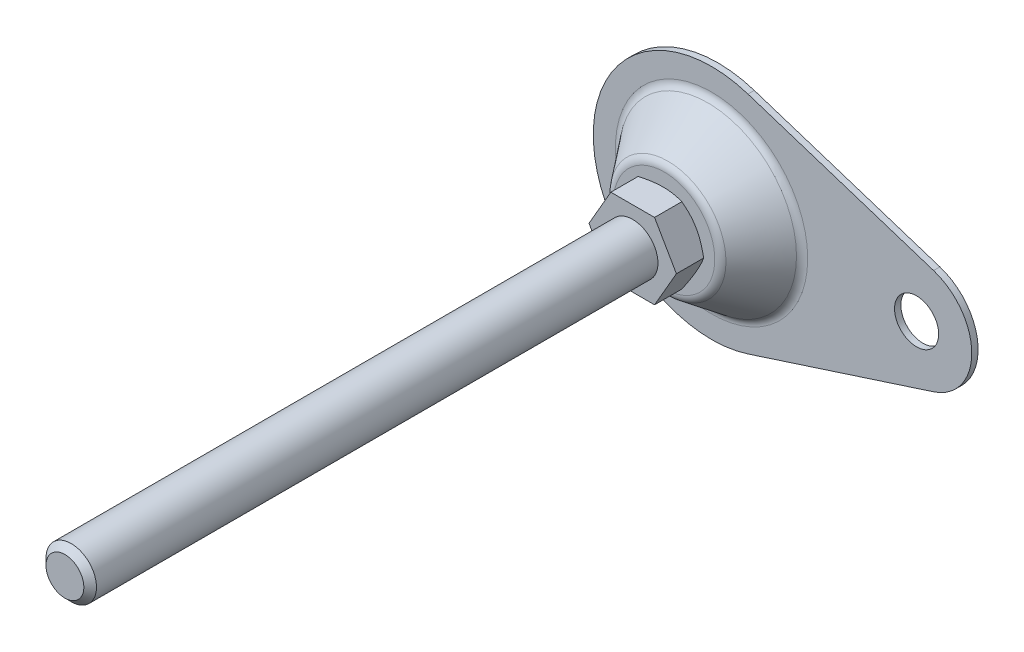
ISO-10303-21;
HEADER;
FILE_DESCRIPTION(('STEP AP214'),'2;1');
FILE_NAME('part.step','',(''),(''),'','','');
FILE_SCHEMA(('AUTOMOTIVE_DESIGN { 1 0 10303 214 1 1 1 1 }'));
ENDSEC;
DATA;
#1=APPLICATION_CONTEXT('core data for automotive mechanical design processes');
#2=APPLICATION_PROTOCOL_DEFINITION('international standard','automotive_design',2000,#1);
#3=PRODUCT_CONTEXT('',#1,'mechanical');
#4=PRODUCT('Part','Part','',(#3));
#5=PRODUCT_RELATED_PRODUCT_CATEGORY('part','',(#4));
#6=PRODUCT_DEFINITION_FORMATION('','',#4);
#7=PRODUCT_DEFINITION_CONTEXT('part definition',#1,'design');
#8=PRODUCT_DEFINITION('design','',#6,#7);
#9=PRODUCT_DEFINITION_SHAPE('','',#8);
#10=(LENGTH_UNIT() NAMED_UNIT(*) SI_UNIT(.MILLI.,.METRE.));
#11=(NAMED_UNIT(*) PLANE_ANGLE_UNIT() SI_UNIT($,.RADIAN.));
#12=(NAMED_UNIT(*) SI_UNIT($,.STERADIAN.) SOLID_ANGLE_UNIT());
#13=UNCERTAINTY_MEASURE_WITH_UNIT(LENGTH_MEASURE(1.E-05),#10,'distance_accuracy_value','');
#14=(GEOMETRIC_REPRESENTATION_CONTEXT(3) GLOBAL_UNCERTAINTY_ASSIGNED_CONTEXT((#13)) GLOBAL_UNIT_ASSIGNED_CONTEXT((#10,
#11,#12)) REPRESENTATION_CONTEXT('',''));
#15=CARTESIAN_POINT('',(0.,0.,0.));
#16=DIRECTION('',(0.,0.,1.));
#17=DIRECTION('',(1.,0.,0.));
#18=AXIS2_PLACEMENT_3D('',#15,#16,#17);
#19=CARTESIAN_POINT('',(65.,0.,2.));
#20=DIRECTION('',(0.,0.,1.));
#21=DIRECTION('',(1.,0.,0.));
#22=AXIS2_PLACEMENT_3D('',#19,#20,#21);
#23=PLANE('',#22);
#24=CARTESIAN_POINT('',(0.,0.,2.));
#25=DIRECTION('',(0.,0.,1.));
#26=DIRECTION('',(1.,0.,0.));
#27=AXIS2_PLACEMENT_3D('',#24,#25,#26);
#28=CIRCLE('',#27,30.4802116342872);
#29=CARTESIAN_POINT('',(30.4802116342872,0.,2.));
#30=VERTEX_POINT('',#29);
#31=EDGE_CURVE('E245',#30,#30,#28,.F.);
#32=ORIENTED_EDGE('',*,*,#31,.T.);
#33=EDGE_LOOP('',(#32));
#34=FACE_BOUND('',#33,.T.);
#35=CARTESIAN_POINT('',(65.,0.,2.));
#36=DIRECTION('',(0.,0.,1.));
#37=DIRECTION('',(1.,0.,0.));
#38=AXIS2_PLACEMENT_3D('',#35,#36,#37);
#39=CIRCLE('',#38,7.);
#40=CARTESIAN_POINT('',(72.,0.,2.));
#41=VERTEX_POINT('',#40);
#42=EDGE_CURVE('E262',#41,#41,#39,.T.);
#43=ORIENTED_EDGE('',*,*,#42,.F.);
#44=EDGE_LOOP('',(#43));
#45=FACE_BOUND('',#44,.T.);
#46=DIRECTION('',(-0.951485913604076,0.307692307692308,0.));
#47=VECTOR('',#46,1.);
#48=CARTESIAN_POINT('',(11.5384615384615,35.6807217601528,2.));
#49=LINE('',#48,#47);
#50=CARTESIAN_POINT('',(70.3846153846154,16.6510034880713,2.));
#51=VERTEX_POINT('',#50);
#52=CARTESIAN_POINT('',(11.5384615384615,35.6807217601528,2.));
#53=VERTEX_POINT('',#52);
#54=EDGE_CURVE('E112',#51,#53,#49,.T.);
#55=ORIENTED_EDGE('',*,*,#54,.T.);
#56=CARTESIAN_POINT('',(0.,0.,2.));
#57=DIRECTION('',(0.,0.,1.));
#58=DIRECTION('',(1.,0.,0.));
#59=AXIS2_PLACEMENT_3D('',#56,#57,#58);
#60=CIRCLE('',#59,37.5);
#61=CARTESIAN_POINT('',(11.5384615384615,-35.6807217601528,2.));
#62=VERTEX_POINT('',#61);
#63=EDGE_CURVE('E114',#53,#62,#60,.T.);
#64=ORIENTED_EDGE('',*,*,#63,.T.);
#65=DIRECTION('',(0.951485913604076,0.307692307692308,0.));
#66=VECTOR('',#65,1.);
#67=CARTESIAN_POINT('',(11.5384615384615,-35.6807217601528,2.));
#68=LINE('',#67,#66);
#69=CARTESIAN_POINT('',(70.3846153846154,-16.6510034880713,2.));
#70=VERTEX_POINT('',#69);
#71=EDGE_CURVE('E97',#62,#70,#68,.T.);
#72=ORIENTED_EDGE('',*,*,#71,.T.);
#73=CARTESIAN_POINT('',(65.,0.,2.));
#74=DIRECTION('',(0.,0.,1.));
#75=DIRECTION('',(1.,0.,0.));
#76=AXIS2_PLACEMENT_3D('',#73,#74,#75);
#77=CIRCLE('',#76,17.5);
#78=EDGE_CURVE('E106',#70,#51,#77,.T.);
#79=ORIENTED_EDGE('',*,*,#78,.T.);
#80=EDGE_LOOP('',(#55,#64,#72,#79));
#81=FACE_BOUND('',#80,.T.);
#82=ADVANCED_FACE('F14',(#34,#45,#81),#23,.T.);
#83=CARTESIAN_POINT('',(65.,0.,0.));
#84=DIRECTION('',(0.,0.,1.));
#85=DIRECTION('',(1.,0.,0.));
#86=AXIS2_PLACEMENT_3D('',#83,#84,#85);
#87=PLANE('',#86);
#88=CARTESIAN_POINT('',(65.,0.,0.));
#89=DIRECTION('',(0.,0.,1.));
#90=DIRECTION('',(1.,0.,0.));
#91=AXIS2_PLACEMENT_3D('',#88,#89,#90);
#92=CIRCLE('',#91,7.);
#93=CARTESIAN_POINT('',(72.,0.,0.));
#94=VERTEX_POINT('',#93);
#95=EDGE_CURVE('E258',#94,#94,#92,.T.);
#96=ORIENTED_EDGE('',*,*,#95,.T.);
#97=EDGE_LOOP('',(#96));
#98=FACE_BOUND('',#97,.T.);
#99=CARTESIAN_POINT('',(0.,0.,0.));
#100=DIRECTION('',(0.,0.,1.));
#101=DIRECTION('',(1.,0.,0.));
#102=AXIS2_PLACEMENT_3D('',#99,#100,#101);
#103=CIRCLE('',#102,37.5);
#104=CARTESIAN_POINT('',(11.5384615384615,35.6807217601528,0.));
#105=VERTEX_POINT('',#104);
#106=CARTESIAN_POINT('',(11.5384615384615,-35.6807217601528,0.));
#107=VERTEX_POINT('',#106);
#108=EDGE_CURVE('E275',#105,#107,#103,.T.);
#109=ORIENTED_EDGE('',*,*,#108,.F.);
#110=DIRECTION('',(-0.951485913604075,0.307692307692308,0.));
#111=VECTOR('',#110,1.);
#112=CARTESIAN_POINT('',(70.3846153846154,16.6510034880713,0.));
#113=LINE('',#112,#111);
#114=CARTESIAN_POINT('',(70.3846153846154,16.6510034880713,0.));
#115=VERTEX_POINT('',#114);
#116=EDGE_CURVE('E9',#115,#105,#113,.T.);
#117=ORIENTED_EDGE('',*,*,#116,.F.);
#118=CARTESIAN_POINT('',(65.,0.,0.));
#119=DIRECTION('',(0.,0.,1.));
#120=DIRECTION('',(1.,0.,0.));
#121=AXIS2_PLACEMENT_3D('',#118,#119,#120);
#122=CIRCLE('',#121,17.5);
#123=CARTESIAN_POINT('',(70.3846153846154,-16.6510034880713,0.));
#124=VERTEX_POINT('',#123);
#125=EDGE_CURVE('E22',#124,#115,#122,.T.);
#126=ORIENTED_EDGE('',*,*,#125,.F.);
#127=DIRECTION('',(0.951485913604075,0.307692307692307,0.));
#128=VECTOR('',#127,1.);
#129=CARTESIAN_POINT('',(70.3846153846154,-16.6510034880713,0.));
#130=LINE('',#129,#128);
#131=EDGE_CURVE('E99',#107,#124,#130,.T.);
#132=ORIENTED_EDGE('',*,*,#131,.F.);
#133=EDGE_LOOP('',(#109,#117,#126,#132));
#134=FACE_BOUND('',#133,.T.);
#135=ADVANCED_FACE('F215',(#98,#134),#87,.F.);
#136=CARTESIAN_POINT('',(0.,0.,17.));
#137=DIRECTION('',(0.,0.,-1.));
#138=DIRECTION('',(-1.,0.,0.));
#139=AXIS2_PLACEMENT_3D('',#136,#137,#138);
#140=PLANE('',#139);
#141=CARTESIAN_POINT('',(0.,0.,17.));
#142=DIRECTION('',(0.,0.,-1.));
#143=DIRECTION('',(-1.,0.,0.));
#144=AXIS2_PLACEMENT_3D('',#141,#142,#143);
#145=CIRCLE('',#144,16.0197883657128);
#146=CARTESIAN_POINT('',(-16.0197883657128,0.,17.));
#147=VERTEX_POINT('',#146);
#148=EDGE_CURVE('E278',#147,#147,#145,.F.);
#149=ORIENTED_EDGE('',*,*,#148,.T.);
#150=EDGE_LOOP('',(#149));
#151=FACE_BOUND('',#150,.T.);
#152=CARTESIAN_POINT('',(0.,0.,17.));
#153=DIRECTION('',(0.,0.,-1.));
#154=DIRECTION('',(-1.,0.,0.));
#155=AXIS2_PLACEMENT_3D('',#152,#153,#154);
#156=CIRCLE('',#155,11.5);
#157=CARTESIAN_POINT('',(-11.5,0.,17.));
#158=VERTEX_POINT('',#157);
#159=EDGE_CURVE('E122',#158,#158,#156,.T.);
#160=ORIENTED_EDGE('',*,*,#159,.T.);
#161=EDGE_LOOP('',(#160));
#162=FACE_BOUND('',#161,.T.);
#163=ADVANCED_FACE('F211',(#151,#162),#140,.F.);
#164=CARTESIAN_POINT('',(0.,0.,5.));
#165=DIRECTION('',(0.,0.,1.));
#166=DIRECTION('',(1.,0.,0.));
#167=AXIS2_PLACEMENT_3D('',#164,#165,#166);
#168=TOROIDAL_SURFACE('',#167,30.4802116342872,3.);
#169=CARTESIAN_POINT('',(0.,0.,3.1747053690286));
#170=DIRECTION('',(0.,0.,1.));
#171=DIRECTION('',(1.,0.,0.));
#172=AXIS2_PLACEMENT_3D('',#169,#170,#171);
#173=CIRCLE('',#172,28.0993925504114);
#174=CARTESIAN_POINT('',(28.0993925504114,0.,3.1747053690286));
#175=VERTEX_POINT('',#174);
#176=EDGE_CURVE('E242',#175,#175,#173,.T.);
#177=ORIENTED_EDGE('',*,*,#176,.F.);
#178=EDGE_LOOP('',(#177));
#179=FACE_BOUND('',#178,.T.);
#180=ORIENTED_EDGE('',*,*,#31,.F.);
#181=EDGE_LOOP('',(#180));
#182=FACE_BOUND('',#181,.T.);
#183=ADVANCED_FACE('F214',(#179,#182),#168,.F.);
#184=CARTESIAN_POINT('',(0.,0.,14.));
#185=DIRECTION('',(0.,0.,-1.));
#186=DIRECTION('',(-1.,0.,0.));
#187=AXIS2_PLACEMENT_3D('',#184,#185,#186);
#188=TOROIDAL_SURFACE('',#187,16.0197883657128,3.);
#189=ORIENTED_EDGE('',*,*,#148,.F.);
#190=EDGE_LOOP('',(#189));
#191=FACE_BOUND('',#190,.T.);
#192=CARTESIAN_POINT('',(0.,0.,15.8252946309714));
#193=DIRECTION('',(0.,0.,1.));
#194=DIRECTION('',(1.,0.,0.));
#195=AXIS2_PLACEMENT_3D('',#192,#193,#194);
#196=CIRCLE('',#195,18.4006074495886);
#197=CARTESIAN_POINT('',(18.4006074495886,0.,15.8252946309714));
#198=VERTEX_POINT('',#197);
#199=EDGE_CURVE('E251',#198,#198,#196,.F.);
#200=ORIENTED_EDGE('',*,*,#199,.F.);
#201=EDGE_LOOP('',(#200));
#202=FACE_BOUND('',#201,.T.);
#203=ADVANCED_FACE('F229',(#191,#202),#188,.T.);
#204=CARTESIAN_POINT('',(0.,0.,2.));
#205=DIRECTION('',(0.,0.,-1.));
#206=DIRECTION('',(-1.,0.,0.));
#207=AXIS2_PLACEMENT_3D('',#204,#205,#206);
#208=CYLINDRICAL_SURFACE('',#207,37.5);
#209=ORIENTED_EDGE('',*,*,#108,.T.);
#210=DIRECTION('',(0.,0.,1.));
#211=VECTOR('',#210,1.);
#212=CARTESIAN_POINT('',(11.5384615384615,-35.6807217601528,-8.));
#213=LINE('',#212,#211);
#214=EDGE_CURVE('E103',#107,#62,#213,.T.);
#215=ORIENTED_EDGE('',*,*,#214,.T.);
#216=ORIENTED_EDGE('',*,*,#63,.F.);
#217=DIRECTION('',(0.,0.,1.));
#218=VECTOR('',#217,1.);
#219=CARTESIAN_POINT('',(11.5384615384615,35.6807217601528,-8.));
#220=LINE('',#219,#218);
#221=EDGE_CURVE('E119',#105,#53,#220,.T.);
#222=ORIENTED_EDGE('',*,*,#221,.F.);
#223=EDGE_LOOP('',(#209,#215,#216,#222));
#224=FACE_BOUND('',#223,.T.);
#225=ADVANCED_FACE('F219',(#224),#208,.T.);
#226=CARTESIAN_POINT('',(65.,0.,2.));
#227=DIRECTION('',(0.,0.,-1.));
#228=DIRECTION('',(-1.,0.,0.));
#229=AXIS2_PLACEMENT_3D('',#226,#227,#228);
#230=CYLINDRICAL_SURFACE('',#229,7.);
#231=ORIENTED_EDGE('',*,*,#42,.T.);
#232=EDGE_LOOP('',(#231));
#233=FACE_BOUND('',#232,.T.);
#234=ORIENTED_EDGE('',*,*,#95,.F.);
#235=EDGE_LOOP('',(#234));
#236=FACE_BOUND('',#235,.T.);
#237=ADVANCED_FACE('F209',(#233,#236),#230,.F.);
#238=CARTESIAN_POINT('',(0.,0.,2.));
#239=DIRECTION('',(0.,0.,-1.));
#240=DIRECTION('',(-1.,0.,0.));
#241=AXIS2_PLACEMENT_3D('',#238,#239,#240);
#242=CONICAL_SURFACE('',#241,29.,0.654082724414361);
#243=ORIENTED_EDGE('',*,*,#176,.T.);
#244=EDGE_LOOP('',(#243));
#245=FACE_BOUND('',#244,.T.);
#246=ORIENTED_EDGE('',*,*,#199,.T.);
#247=EDGE_LOOP('',(#246));
#248=FACE_BOUND('',#247,.T.);
#249=ADVANCED_FACE('F151',(#245,#248),#242,.T.);
#250=CARTESIAN_POINT('',(0.,0.,17.));
#251=DIRECTION('',(0.,0.,1.));
#252=DIRECTION('',(1.,0.,0.));
#253=AXIS2_PLACEMENT_3D('',#250,#251,#252);
#254=CONICAL_SURFACE('',#253,11.5,1.0471975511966);
#255=ORIENTED_EDGE('',*,*,#159,.F.);
#256=EDGE_LOOP('',(#255));
#257=FACE_BOUND('',#256,.T.);
#258=CARTESIAN_POINT('',(13.8565219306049,0.000200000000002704,18.3605385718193));
#259=CARTESIAN_POINT('',(13.7042251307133,-0.263585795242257,18.2726247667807));
#260=CARTESIAN_POINT('',(13.5513604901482,-0.528355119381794,18.1887011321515));
#261=CARTESIAN_POINT('',(13.244405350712,-1.06001701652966,18.0299413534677));
#262=CARTESIAN_POINT('',(13.0903144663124,-1.32691025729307,17.9551081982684));
#263=CARTESIAN_POINT('',(12.6255589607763,-2.131890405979,17.745692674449));
#264=CARTESIAN_POINT('',(12.3130596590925,-2.6731550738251,17.6265783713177));
#265=CARTESIAN_POINT('',(11.8454187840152,-3.48313282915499,17.486906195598));
#266=CARTESIAN_POINT('',(11.6916742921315,-3.74942610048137,17.4471189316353));
#267=CARTESIAN_POINT('',(11.3834734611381,-4.28324559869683,17.3803985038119));
#268=CARTESIAN_POINT('',(11.2290171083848,-4.55077184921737,17.3534655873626));
#269=CARTESIAN_POINT('',(10.9198468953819,-5.08627036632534,17.3131437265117));
#270=CARTESIAN_POINT('',(10.7651335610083,-5.35424172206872,17.2997386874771));
#271=CARTESIAN_POINT('',(10.4555635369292,-5.89043273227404,17.286758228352));
#272=CARTESIAN_POINT('',(10.3007068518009,-6.15865237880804,17.2871823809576));
#273=CARTESIAN_POINT('',(10.0112020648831,-6.66008937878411,17.3008951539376));
#274=CARTESIAN_POINT('',(9.87653331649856,-6.89334249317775,17.3125111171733));
#275=CARTESIAN_POINT('',(9.60750555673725,-7.35931224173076,17.3459831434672));
#276=CARTESIAN_POINT('',(9.47314656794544,-7.59202883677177,17.367839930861));
#277=CARTESIAN_POINT('',(9.2048113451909,-8.05679907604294,17.4214125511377));
#278=CARTESIAN_POINT('',(9.07083551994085,-8.288852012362,17.4531365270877));
#279=CARTESIAN_POINT('',(8.80351197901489,-8.75186996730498,17.5258869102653));
#280=CARTESIAN_POINT('',(8.67016430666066,-8.98283491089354,17.566913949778));
#281=CARTESIAN_POINT('',(8.2653799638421,-9.68394195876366,17.7049867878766));
#282=CARTESIAN_POINT('',(7.99511549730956,-10.1520537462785,17.8158000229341));
#283=CARTESIAN_POINT('',(7.45861659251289,-11.0812971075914,18.0673009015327));
#284=CARTESIAN_POINT('',(7.19237528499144,-11.5424405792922,18.2079294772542));
#285=CARTESIAN_POINT('',(6.92808776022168,-12.0002,18.3605385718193));
#286=B_SPLINE_CURVE_WITH_KNOTS('',3,(#258,#259,#260,#261,#262,#263,#264,#265,#266,#267,#268,
#269,#270,#271,#272,#273,#274,#275,#276,#277,#278,#279,#280,#281,#282,#283,#284,#285),
.UNSPECIFIED.,.F.,.F.,(4,2,2,2,2,2,2,2,2,2,2,2,2,4),(0.,0.951004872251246,1.90232158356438,
3.80900466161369,4.7389455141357,5.66890426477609,6.59775529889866,7.52657763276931,
8.33514643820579,9.1437724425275,9.95306755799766,10.7624176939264,12.4167102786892,
14.0677556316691),.UNSPECIFIED.);
#287=CARTESIAN_POINT('',(13.856406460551,0.,18.3604719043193));
#288=VERTEX_POINT('',#287);
#289=CARTESIAN_POINT('',(6.92820323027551,-12.,18.3604719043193));
#290=VERTEX_POINT('',#289);
#291=EDGE_CURVE('E29',#288,#290,#286,.T.);
#292=ORIENTED_EDGE('',*,*,#291,.T.);
#293=CARTESIAN_POINT('',(-18.8282470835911,-12.,23.2510742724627));
#294=CARTESIAN_POINT('',(-18.5652198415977,-12.,23.1230159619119));
#295=CARTESIAN_POINT('',(-18.3018897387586,-12.,22.9955800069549));
#296=CARTESIAN_POINT('',(-17.7745606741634,-12.,22.7420933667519));
#297=CARTESIAN_POINT('',(-17.5105617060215,-12.,22.6160426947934));
#298=CARTESIAN_POINT('',(-16.7173993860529,-12.,22.2401475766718));
#299=CARTESIAN_POINT('',(-16.18714518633,-12.,21.9925964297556));
#300=CARTESIAN_POINT('',(-15.1203781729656,-12.,21.5037801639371));
#301=CARTESIAN_POINT('',(-14.5838471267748,-12.,21.2625547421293));
#302=CARTESIAN_POINT('',(-13.5065929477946,-12.,20.7896870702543));
#303=CARTESIAN_POINT('',(-12.9658700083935,-12.,20.5580443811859));
#304=CARTESIAN_POINT('',(-11.8612739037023,-12.,20.0993560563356));
#305=CARTESIAN_POINT('',(-11.2972295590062,-12.,19.8727205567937));
#306=CARTESIAN_POINT('',(-10.1626196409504,-12.,19.4360788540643));
#307=CARTESIAN_POINT('',(-9.59205335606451,-12.,19.2260744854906));
#308=CARTESIAN_POINT('',(-8.4445081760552,-12.,18.8280509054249));
#309=CARTESIAN_POINT('',(-7.86754418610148,-12.,18.6399890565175));
#310=CARTESIAN_POINT('',(-6.70528986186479,-12.,18.2917278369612));
#311=CARTESIAN_POINT('',(-6.12000214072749,-12.,18.1315199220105));
#312=CARTESIAN_POINT('',(-5.23729299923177,-12.,17.9182149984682));
#313=CARTESIAN_POINT('',(-4.9430810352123,-12.,17.8517614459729));
#314=CARTESIAN_POINT('',(-4.35260736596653,-12.,17.7286330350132));
#315=CARTESIAN_POINT('',(-4.05634570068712,-12.,17.6719579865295));
#316=CARTESIAN_POINT('',(-3.46196242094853,-12.,17.5693732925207));
#317=CARTESIAN_POINT('',(-3.16384085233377,-12.,17.5234633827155));
#318=CARTESIAN_POINT('',(-2.56603409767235,-12.,17.4433156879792));
#319=CARTESIAN_POINT('',(-2.26634897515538,-12.,17.4090774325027));
#320=CARTESIAN_POINT('',(-1.66984341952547,-12.,17.3533951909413));
#321=CARTESIAN_POINT('',(-1.3730385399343,-12.,17.3317856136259));
#322=CARTESIAN_POINT('',(-0.778780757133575,-12.,17.3011473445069));
#323=CARTESIAN_POINT('',(-0.48132786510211,-12.,17.2921184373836));
#324=CARTESIAN_POINT('',(0.113696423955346,-12.,17.2868573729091));
#325=CARTESIAN_POINT('',(0.411267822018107,-12.,17.2906253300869));
#326=CARTESIAN_POINT('',(1.00598148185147,-12.,17.3108635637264));
#327=CARTESIAN_POINT('',(1.30312372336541,-12.,17.3273344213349));
#328=CARTESIAN_POINT('',(2.01058359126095,-12.,17.3813178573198));
#329=CARTESIAN_POINT('',(2.4204793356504,-12.,17.4244865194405));
#330=CARTESIAN_POINT('',(3.23735230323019,-12.,17.532691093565));
#331=CARTESIAN_POINT('',(3.64432914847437,-12.,17.59772978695));
#332=CARTESIAN_POINT('',(4.86033233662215,-12.,17.8222120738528));
#333=CARTESIAN_POINT('',(5.66402260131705,-12.,18.010986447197));
#334=CARTESIAN_POINT('',(6.86636162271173,-12.,18.3399927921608));
#335=CARTESIAN_POINT('',(7.27119703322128,-12.,18.4589295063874));
#336=CARTESIAN_POINT('',(8.07693854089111,-12.,18.7095598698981));
#337=CARTESIAN_POINT('',(8.47784460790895,-12.,18.8412536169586));
#338=CARTESIAN_POINT('',(9.27585110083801,-12.,19.1152514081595));
#339=CARTESIAN_POINT('',(9.67295259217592,-12.,19.2575523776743));
#340=CARTESIAN_POINT('',(10.4638334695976,-12.,19.5510497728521));
#341=CARTESIAN_POINT('',(10.857612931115,-12.,19.7022459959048));
#342=CARTESIAN_POINT('',(11.9182337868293,-12.,20.1210370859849));
#343=CARTESIAN_POINT('',(12.5822860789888,-12.,20.3956888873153));
#344=CARTESIAN_POINT('',(13.9035715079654,-12.,20.9609897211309));
#345=CARTESIAN_POINT('',(14.5608038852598,-12.,21.2516405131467));
#346=CARTESIAN_POINT('',(15.870018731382,-12.,21.8451456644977));
#347=CARTESIAN_POINT('',(16.5219991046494,-12.,22.1480046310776));
#348=CARTESIAN_POINT('',(17.8215214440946,-12.,22.7630019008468));
#349=CARTESIAN_POINT('',(18.4690635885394,-12.,23.0751398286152));
#350=CARTESIAN_POINT('',(19.7616211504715,-12.,23.7071754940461));
#351=CARTESIAN_POINT('',(20.4066308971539,-12.,24.0270848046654));
#352=CARTESIAN_POINT('',(21.6937566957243,-12.,24.6726762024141));
#353=CARTESIAN_POINT('',(22.3358727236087,-12.,24.9983583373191));
#354=CARTESIAN_POINT('',(23.6175900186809,-12.,25.6542896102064));
#355=CARTESIAN_POINT('',(24.2571917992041,-12.,25.9845377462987));
#356=CARTESIAN_POINT('',(25.5344252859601,-12.,26.6488129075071));
#357=CARTESIAN_POINT('',(26.1720569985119,-12.,26.9828399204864));
#358=CARTESIAN_POINT('',(27.9477087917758,-12.,27.9185379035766));
#359=CARTESIAN_POINT('',(29.0839339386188,-12.,28.5236143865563));
#360=CARTESIAN_POINT('',(31.3526004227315,-12.,29.740969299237));
#361=CARTESIAN_POINT('',(32.485041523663,-12.,30.3532481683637));
#362=CARTESIAN_POINT('',(34.7432444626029,-12.,31.5811337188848));
#363=CARTESIAN_POINT('',(35.8690159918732,-12.,32.1967225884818));
#364=CARTESIAN_POINT('',(37.5559414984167,-12.,33.1231521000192));
#365=CARTESIAN_POINT('',(38.1179396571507,-12.,33.4324576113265));
#366=CARTESIAN_POINT('',(39.2414334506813,-12.,34.0519783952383));
#367=CARTESIAN_POINT('',(39.8029290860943,-12.,34.3621936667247));
#368=CARTESIAN_POINT('',(40.364204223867,-12.,34.6728074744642));
#369=B_SPLINE_CURVE_WITH_KNOTS('',3,(#293,#294,#295,#296,#297,#298,#299,#300,#301,#302,#303,
#304,#305,#306,#307,#308,#309,#310,#311,#312,#313,#314,#315,#316,#317,#318,#319,#320,#321,#322,
#323,#324,#325,#326,#327,#328,#329,#330,#331,#332,#333,#334,#335,#336,#337,#338,#339,#340,#341,
#342,#343,#344,#345,#346,#347,#348,#349,#350,#351,#352,#353,#354,#355,#356,#357,#358,#359,#360,
#361,#362,#363,#364,#365,#366,#367,#368),.UNSPECIFIED.,.F.,.F.,(4,2,2,2,2,2,2,2,2,2,2,2,2,2,2,2,
2,2,2,2,2,2,2,2,2,2,2,2,2,2,2,2,2,2,2,2,2,4),(0.,0.877631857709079,1.75527212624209,
3.5108015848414,5.27552233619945,7.0401621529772,8.86358105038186,10.6872008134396,
12.5072158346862,14.3266715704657,15.2314059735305,16.1361227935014,17.0408174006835,
17.9454755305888,18.8379887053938,19.7304866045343,20.6229924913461,21.5155392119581,
22.7513338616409,23.987285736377,26.4604147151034,27.7261381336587,28.9918712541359,
30.2572389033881,31.5225777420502,33.6780909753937,35.8338417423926,37.9904138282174,
40.1468987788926,42.3068201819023,44.4667594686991,46.6262321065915,48.7856978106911,
52.6475386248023,56.5096162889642,60.3588641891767,62.2833392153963,64.2078118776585),.UNSPECIFIED.);
#370=CARTESIAN_POINT('',(-6.92820323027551,-12.,18.3604719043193));
#371=VERTEX_POINT('',#370);
#372=EDGE_CURVE('E158',#290,#371,#369,.F.);
#373=ORIENTED_EDGE('',*,*,#372,.T.);
#374=CARTESIAN_POINT('',(-6.92808776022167,-12.0002,18.3605385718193));
#375=CARTESIAN_POINT('',(-7.08038456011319,-11.7364142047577,18.2726247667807));
#376=CARTESIAN_POINT('',(-7.23324920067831,-11.4716448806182,18.1887011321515));
#377=CARTESIAN_POINT('',(-7.5402043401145,-10.9399829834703,18.0299413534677));
#378=CARTESIAN_POINT('',(-7.69429522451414,-10.6730897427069,17.9551081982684));
#379=CARTESIAN_POINT('',(-8.15905073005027,-9.868109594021,17.745692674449));
#380=CARTESIAN_POINT('',(-8.47155003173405,-9.32684492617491,17.6265783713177));
#381=CARTESIAN_POINT('',(-8.93919090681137,-8.51686717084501,17.486906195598));
#382=CARTESIAN_POINT('',(-9.09293539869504,-8.25057389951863,17.4471189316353));
#383=CARTESIAN_POINT('',(-9.40113622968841,-7.71675440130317,17.3803985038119));
#384=CARTESIAN_POINT('',(-9.55559258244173,-7.44922815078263,17.3534655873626));
#385=CARTESIAN_POINT('',(-9.86476279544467,-6.91372963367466,17.3131437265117));
#386=CARTESIAN_POINT('',(-10.0194761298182,-6.64575827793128,17.2997386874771));
#387=CARTESIAN_POINT('',(-10.3290461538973,-6.10956726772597,17.286758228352));
#388=CARTESIAN_POINT('',(-10.4839028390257,-5.84134762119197,17.2871823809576));
#389=CARTESIAN_POINT('',(-10.7734076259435,-5.3399106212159,17.3008951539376));
#390=CARTESIAN_POINT('',(-10.908076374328,-5.10665750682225,17.3125111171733));
#391=CARTESIAN_POINT('',(-11.1771041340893,-4.64068775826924,17.3459831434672));
#392=CARTESIAN_POINT('',(-11.3114631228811,-4.40797116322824,17.367839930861));
#393=CARTESIAN_POINT('',(-11.5797983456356,-3.94320092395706,17.4214125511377));
#394=CARTESIAN_POINT('',(-11.7137741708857,-3.711147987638,17.4531365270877));
#395=CARTESIAN_POINT('',(-11.9810977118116,-3.24813003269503,17.5258869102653));
#396=CARTESIAN_POINT('',(-12.1144453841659,-3.01716508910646,17.566913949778));
#397=CARTESIAN_POINT('',(-12.5192297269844,-2.31605804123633,17.7049867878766));
#398=CARTESIAN_POINT('',(-12.789494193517,-1.84794625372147,17.8158000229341));
#399=CARTESIAN_POINT('',(-13.3259930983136,-0.918702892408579,18.0673009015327));
#400=CARTESIAN_POINT('',(-13.5922344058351,-0.457559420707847,18.2079294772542));
#401=CARTESIAN_POINT('',(-13.8565219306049,0.000199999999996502,18.3605385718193));
#402=B_SPLINE_CURVE_WITH_KNOTS('',3,(#374,#375,#376,#377,#378,#379,#380,#381,#382,#383,#384,
#385,#386,#387,#388,#389,#390,#391,#392,#393,#394,#395,#396,#397,#398,#399,#400,#401),
.UNSPECIFIED.,.F.,.F.,(4,2,2,2,2,2,2,2,2,2,2,2,2,4),(0.,0.951004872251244,1.90232158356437,
3.80900466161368,4.7389455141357,5.66890426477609,6.59775529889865,7.5265776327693,
8.33514643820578,9.14377244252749,9.95306755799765,10.7624176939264,12.4167102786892,
14.0677556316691),.UNSPECIFIED.);
#403=CARTESIAN_POINT('',(-13.856406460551,0.,18.3604719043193));
#404=VERTEX_POINT('',#403);
#405=EDGE_CURVE('E127',#371,#404,#402,.T.);
#406=ORIENTED_EDGE('',*,*,#405,.T.);
#407=CARTESIAN_POINT('',(-13.8565219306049,-0.000200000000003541,18.3605385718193));
#408=CARTESIAN_POINT('',(-13.7042251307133,0.26358579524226,18.2726247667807));
#409=CARTESIAN_POINT('',(-13.5513604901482,0.528355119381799,18.1887011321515));
#410=CARTESIAN_POINT('',(-13.244405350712,1.06001701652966,18.0299413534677));
#411=CARTESIAN_POINT('',(-13.0903144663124,1.32691025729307,17.9551081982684));
#412=CARTESIAN_POINT('',(-12.6255589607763,2.13189040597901,17.745692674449));
#413=CARTESIAN_POINT('',(-12.3130596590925,2.6731550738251,17.6265783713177));
#414=CARTESIAN_POINT('',(-11.8454187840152,3.483132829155,17.486906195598));
#415=CARTESIAN_POINT('',(-11.6916742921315,3.74942610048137,17.4471189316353));
#416=CARTESIAN_POINT('',(-11.3834734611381,4.28324559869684,17.3803985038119));
#417=CARTESIAN_POINT('',(-11.2290171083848,4.55077184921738,17.3534655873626));
#418=CARTESIAN_POINT('',(-10.9198468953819,5.08627036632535,17.3131437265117));
#419=CARTESIAN_POINT('',(-10.7651335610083,5.35424172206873,17.2997386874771));
#420=CARTESIAN_POINT('',(-10.4555635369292,5.89043273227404,17.286758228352));
#421=CARTESIAN_POINT('',(-10.3007068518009,6.15865237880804,17.2871823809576));
#422=CARTESIAN_POINT('',(-10.0112020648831,6.66008937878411,17.3008951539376));
#423=CARTESIAN_POINT('',(-9.87653331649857,6.89334249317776,17.3125111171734));
#424=CARTESIAN_POINT('',(-9.60750555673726,7.35931224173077,17.3459831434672));
#425=CARTESIAN_POINT('',(-9.47314656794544,7.59202883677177,17.367839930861));
#426=CARTESIAN_POINT('',(-9.20481134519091,8.05679907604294,17.4214125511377));
#427=CARTESIAN_POINT('',(-9.07083551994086,8.288852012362,17.4531365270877));
#428=CARTESIAN_POINT('',(-8.8035119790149,8.75186996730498,17.5258869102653));
#429=CARTESIAN_POINT('',(-8.67016430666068,8.98283491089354,17.566913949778));
#430=CARTESIAN_POINT('',(-8.26537996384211,9.68394195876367,17.7049867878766));
#431=CARTESIAN_POINT('',(-7.99511549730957,10.1520537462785,17.8158000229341));
#432=CARTESIAN_POINT('',(-7.4586165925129,11.0812971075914,18.0673009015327));
#433=CARTESIAN_POINT('',(-7.19237528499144,11.5424405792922,18.2079294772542));
#434=CARTESIAN_POINT('',(-6.92808776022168,12.0002,18.3605385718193));
#435=B_SPLINE_CURVE_WITH_KNOTS('',3,(#407,#408,#409,#410,#411,#412,#413,#414,#415,#416,#417,
#418,#419,#420,#421,#422,#423,#424,#425,#426,#427,#428,#429,#430,#431,#432,#433,#434),
.UNSPECIFIED.,.F.,.F.,(4,2,2,2,2,2,2,2,2,2,2,2,2,4),(0.,0.951004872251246,1.90232158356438,
3.80900466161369,4.7389455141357,5.66890426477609,6.59775529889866,7.52657763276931,
8.33514643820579,9.14377244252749,9.95306755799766,10.7624176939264,12.4167102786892,
14.0677556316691),.UNSPECIFIED.);
#436=CARTESIAN_POINT('',(-6.92820323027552,12.,18.3604719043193));
#437=VERTEX_POINT('',#436);
#438=EDGE_CURVE('E135',#404,#437,#435,.T.);
#439=ORIENTED_EDGE('',*,*,#438,.T.);
#440=CARTESIAN_POINT('',(-18.8282470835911,12.,23.2510742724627));
#441=CARTESIAN_POINT('',(-18.5652198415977,12.,23.1230159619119));
#442=CARTESIAN_POINT('',(-18.3018897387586,12.,22.9955800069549));
#443=CARTESIAN_POINT('',(-17.7745606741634,12.,22.7420933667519));
#444=CARTESIAN_POINT('',(-17.5105617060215,12.,22.6160426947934));
#445=CARTESIAN_POINT('',(-16.7173993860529,12.,22.2401475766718));
#446=CARTESIAN_POINT('',(-16.18714518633,12.,21.9925964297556));
#447=CARTESIAN_POINT('',(-15.1203781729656,12.,21.5037801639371));
#448=CARTESIAN_POINT('',(-14.5838471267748,12.,21.2625547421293));
#449=CARTESIAN_POINT('',(-13.5065929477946,12.,20.7896870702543));
#450=CARTESIAN_POINT('',(-12.9658700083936,12.,20.5580443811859));
#451=CARTESIAN_POINT('',(-11.8612739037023,12.,20.0993560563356));
#452=CARTESIAN_POINT('',(-11.2972295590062,12.,19.8727205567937));
#453=CARTESIAN_POINT('',(-10.1626196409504,12.,19.4360788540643));
#454=CARTESIAN_POINT('',(-9.59205335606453,12.,19.2260744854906));
#455=CARTESIAN_POINT('',(-8.44450817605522,12.,18.8280509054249));
#456=CARTESIAN_POINT('',(-7.8675441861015,12.,18.6399890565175));
#457=CARTESIAN_POINT('',(-6.70528986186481,12.,18.2917278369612));
#458=CARTESIAN_POINT('',(-6.12000214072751,12.,18.1315199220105));
#459=CARTESIAN_POINT('',(-5.23729299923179,12.,17.9182149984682));
#460=CARTESIAN_POINT('',(-4.94308103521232,12.,17.8517614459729));
#461=CARTESIAN_POINT('',(-4.35260736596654,12.,17.7286330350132));
#462=CARTESIAN_POINT('',(-4.05634570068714,12.,17.6719579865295));
#463=CARTESIAN_POINT('',(-3.46196242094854,12.,17.5693732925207));
#464=CARTESIAN_POINT('',(-3.16384085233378,12.,17.5234633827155));
#465=CARTESIAN_POINT('',(-2.56603409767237,12.,17.4433156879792));
#466=CARTESIAN_POINT('',(-2.26634897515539,12.,17.4090774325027));
#467=CARTESIAN_POINT('',(-1.66984341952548,12.,17.3533951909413));
#468=CARTESIAN_POINT('',(-1.37303853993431,12.,17.3317856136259));
#469=CARTESIAN_POINT('',(-0.778780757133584,12.,17.3011473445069));
#470=CARTESIAN_POINT('',(-0.481327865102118,12.,17.2921184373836));
#471=CARTESIAN_POINT('',(0.11369642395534,12.,17.2868573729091));
#472=CARTESIAN_POINT('',(0.411267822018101,12.,17.2906253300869));
#473=CARTESIAN_POINT('',(1.00598148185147,12.,17.3108635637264));
#474=CARTESIAN_POINT('',(1.3031237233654,12.,17.3273344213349));
#475=CARTESIAN_POINT('',(2.01058359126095,12.,17.3813178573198));
#476=CARTESIAN_POINT('',(2.4204793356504,12.,17.4244865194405));
#477=CARTESIAN_POINT('',(3.23735230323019,12.,17.532691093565));
#478=CARTESIAN_POINT('',(3.64432914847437,12.,17.59772978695));
#479=CARTESIAN_POINT('',(4.86033233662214,12.,17.8222120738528));
#480=CARTESIAN_POINT('',(5.66402260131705,12.,18.010986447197));
#481=CARTESIAN_POINT('',(6.86636162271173,12.,18.3399927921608));
#482=CARTESIAN_POINT('',(7.27119703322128,12.,18.4589295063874));
#483=CARTESIAN_POINT('',(8.07693854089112,12.,18.7095598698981));
#484=CARTESIAN_POINT('',(8.47784460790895,12.,18.8412536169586));
#485=CARTESIAN_POINT('',(9.27585110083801,12.,19.1152514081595));
#486=CARTESIAN_POINT('',(9.67295259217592,12.,19.2575523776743));
#487=CARTESIAN_POINT('',(10.4638334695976,12.,19.5510497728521));
#488=CARTESIAN_POINT('',(10.857612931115,12.,19.7022459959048));
#489=CARTESIAN_POINT('',(11.9182337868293,12.,20.1210370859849));
#490=CARTESIAN_POINT('',(12.5822860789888,12.,20.3956888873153));
#491=CARTESIAN_POINT('',(13.9035715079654,12.,20.9609897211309));
#492=CARTESIAN_POINT('',(14.5608038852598,12.,21.2516405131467));
#493=CARTESIAN_POINT('',(15.870018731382,12.,21.8451456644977));
#494=CARTESIAN_POINT('',(16.5219991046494,12.,22.1480046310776));
#495=CARTESIAN_POINT('',(17.8215214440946,12.,22.7630019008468));
#496=CARTESIAN_POINT('',(18.4690635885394,12.,23.0751398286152));
#497=CARTESIAN_POINT('',(19.7616211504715,12.,23.7071754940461));
#498=CARTESIAN_POINT('',(20.4066308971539,12.,24.0270848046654));
#499=CARTESIAN_POINT('',(21.6937566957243,12.,24.6726762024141));
#500=CARTESIAN_POINT('',(22.3358727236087,12.,24.9983583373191));
#501=CARTESIAN_POINT('',(23.6175900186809,12.,25.6542896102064));
#502=CARTESIAN_POINT('',(24.2571917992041,12.,25.9845377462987));
#503=CARTESIAN_POINT('',(25.5344252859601,12.,26.6488129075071));
#504=CARTESIAN_POINT('',(26.1720569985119,12.,26.9828399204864));
#505=CARTESIAN_POINT('',(27.9477087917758,12.,27.9185379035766));
#506=CARTESIAN_POINT('',(29.0839339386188,12.,28.5236143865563));
#507=CARTESIAN_POINT('',(31.3526004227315,12.,29.740969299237));
#508=CARTESIAN_POINT('',(32.485041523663,12.,30.3532481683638));
#509=CARTESIAN_POINT('',(34.7432444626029,12.,31.5811337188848));
#510=CARTESIAN_POINT('',(35.8690159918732,12.,32.1967225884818));
#511=CARTESIAN_POINT('',(37.5559414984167,12.,33.1231521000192));
#512=CARTESIAN_POINT('',(38.1179396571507,12.,33.4324576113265));
#513=CARTESIAN_POINT('',(39.2414334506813,12.,34.0519783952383));
#514=CARTESIAN_POINT('',(39.8029290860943,12.,34.3621936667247));
#515=CARTESIAN_POINT('',(40.364204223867,12.,34.6728074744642));
#516=B_SPLINE_CURVE_WITH_KNOTS('',3,(#440,#441,#442,#443,#444,#445,#446,#447,#448,#449,#450,
#451,#452,#453,#454,#455,#456,#457,#458,#459,#460,#461,#462,#463,#464,#465,#466,#467,#468,#469,
#470,#471,#472,#473,#474,#475,#476,#477,#478,#479,#480,#481,#482,#483,#484,#485,#486,#487,#488,
#489,#490,#491,#492,#493,#494,#495,#496,#497,#498,#499,#500,#501,#502,#503,#504,#505,#506,#507,
#508,#509,#510,#511,#512,#513,#514,#515),.UNSPECIFIED.,.F.,.F.,(4,2,2,2,2,2,2,2,2,2,2,2,2,2,2,2,
2,2,2,2,2,2,2,2,2,2,2,2,2,2,2,2,2,2,2,2,2,4),(0.,0.877631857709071,1.75527212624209,
3.51080158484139,5.27552233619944,7.04016215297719,8.86358105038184,10.6872008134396,
12.5072158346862,14.3266715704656,15.2314059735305,16.1361227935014,17.0408174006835,
17.9454755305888,18.8379887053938,19.7304866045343,20.622992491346,21.5155392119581,
22.7513338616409,23.987285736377,26.4604147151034,27.7261381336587,28.9918712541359,
30.2572389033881,31.5225777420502,33.6780909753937,35.8338417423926,37.9904138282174,
40.1468987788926,42.3068201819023,44.4667594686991,46.6262321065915,48.7856978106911,
52.6475386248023,56.5096162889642,60.3588641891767,62.2833392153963,64.2078118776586),.UNSPECIFIED.);
#517=CARTESIAN_POINT('',(6.92820323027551,12.,18.3604719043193));
#518=VERTEX_POINT('',#517);
#519=EDGE_CURVE('E169',#437,#518,#516,.T.);
#520=ORIENTED_EDGE('',*,*,#519,.T.);
#521=CARTESIAN_POINT('',(6.92808776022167,12.0002,18.3605385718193));
#522=CARTESIAN_POINT('',(7.08038456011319,11.7364142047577,18.2726247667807));
#523=CARTESIAN_POINT('',(7.23324920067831,11.4716448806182,18.1887011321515));
#524=CARTESIAN_POINT('',(7.54020434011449,10.9399829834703,18.0299413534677));
#525=CARTESIAN_POINT('',(7.69429522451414,10.6730897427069,17.9551081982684));
#526=CARTESIAN_POINT('',(8.15905073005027,9.868109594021,17.745692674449));
#527=CARTESIAN_POINT('',(8.47155003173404,9.32684492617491,17.6265783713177));
#528=CARTESIAN_POINT('',(8.93919090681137,8.51686717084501,17.486906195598));
#529=CARTESIAN_POINT('',(9.09293539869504,8.25057389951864,17.4471189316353));
#530=CARTESIAN_POINT('',(9.40113622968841,7.71675440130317,17.3803985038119));
#531=CARTESIAN_POINT('',(9.55559258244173,7.44922815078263,17.3534655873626));
#532=CARTESIAN_POINT('',(9.86476279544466,6.91372963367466,17.3131437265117));
#533=CARTESIAN_POINT('',(10.0194761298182,6.64575827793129,17.2997386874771));
#534=CARTESIAN_POINT('',(10.3290461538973,6.10956726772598,17.286758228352));
#535=CARTESIAN_POINT('',(10.4839028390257,5.84134762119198,17.2871823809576));
#536=CARTESIAN_POINT('',(10.7734076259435,5.33991062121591,17.3008951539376));
#537=CARTESIAN_POINT('',(10.908076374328,5.10665750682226,17.3125111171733));
#538=CARTESIAN_POINT('',(11.1771041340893,4.64068775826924,17.3459831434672));
#539=CARTESIAN_POINT('',(11.3114631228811,4.40797116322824,17.367839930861));
#540=CARTESIAN_POINT('',(11.5797983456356,3.94320092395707,17.4214125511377));
#541=CARTESIAN_POINT('',(11.7137741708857,3.71114798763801,17.4531365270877));
#542=CARTESIAN_POINT('',(11.9810977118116,3.24813003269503,17.5258869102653));
#543=CARTESIAN_POINT('',(12.1144453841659,3.01716508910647,17.566913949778));
#544=CARTESIAN_POINT('',(12.5192297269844,2.31605804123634,17.7049867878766));
#545=CARTESIAN_POINT('',(12.789494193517,1.84794625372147,17.8158000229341));
#546=CARTESIAN_POINT('',(13.3259930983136,0.918702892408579,18.0673009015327));
#547=CARTESIAN_POINT('',(13.5922344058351,0.457559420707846,18.2079294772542));
#548=CARTESIAN_POINT('',(13.8565219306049,-0.000199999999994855,18.3605385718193));
#549=B_SPLINE_CURVE_WITH_KNOTS('',3,(#521,#522,#523,#524,#525,#526,#527,#528,#529,#530,#531,
#532,#533,#534,#535,#536,#537,#538,#539,#540,#541,#542,#543,#544,#545,#546,#547,#548),
.UNSPECIFIED.,.F.,.F.,(4,2,2,2,2,2,2,2,2,2,2,2,2,4),(0.,0.951004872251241,1.90232158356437,
3.80900466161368,4.73894551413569,5.66890426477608,6.59775529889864,7.52657763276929,
8.33514643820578,9.14377244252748,9.95306755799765,10.7624176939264,12.4167102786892,
14.0677556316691),.UNSPECIFIED.);
#550=EDGE_CURVE('E176',#518,#288,#549,.T.);
#551=ORIENTED_EDGE('',*,*,#550,.T.);
#552=EDGE_LOOP('',(#292,#373,#406,#439,#520,#551));
#553=FACE_BOUND('',#552,.T.);
#554=ADVANCED_FACE('F145',(#257,#553),#254,.T.);
#555=CARTESIAN_POINT('',(0.,0.,207.));
#556=DIRECTION('',(0.,0.,1.));
#557=DIRECTION('',(1.,0.,0.));
#558=AXIS2_PLACEMENT_3D('',#555,#556,#557);
#559=PLANE('',#558);
#560=CARTESIAN_POINT('',(0.,0.,207.));
#561=DIRECTION('',(0.,0.,1.));
#562=DIRECTION('',(1.,0.,0.));
#563=AXIS2_PLACEMENT_3D('',#560,#561,#562);
#564=CIRCLE('',#563,6.00000000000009);
#565=CARTESIAN_POINT('',(6.00000000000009,0.,207.));
#566=VERTEX_POINT('',#565);
#567=EDGE_CURVE('E246',#566,#566,#564,.T.);
#568=ORIENTED_EDGE('',*,*,#567,.T.);
#569=EDGE_LOOP('',(#568));
#570=FACE_BOUND('',#569,.T.);
#571=ADVANCED_FACE('F150',(#570),#559,.T.);
#572=CARTESIAN_POINT('',(0.,0.,207.));
#573=DIRECTION('',(0.,0.,-1.));
#574=DIRECTION('',(-1.,0.,0.));
#575=AXIS2_PLACEMENT_3D('',#572,#573,#574);
#576=CONICAL_SURFACE('',#575,6.00000000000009,0.785398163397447);
#577=CARTESIAN_POINT('',(0.,0.,205.));
#578=DIRECTION('',(0.,0.,1.));
#579=DIRECTION('',(1.,0.,0.));
#580=AXIS2_PLACEMENT_3D('',#577,#578,#579);
#581=CIRCLE('',#580,8.);
#582=CARTESIAN_POINT('',(8.,0.,205.));
#583=VERTEX_POINT('',#582);
#584=EDGE_CURVE('E249',#583,#583,#581,.F.);
#585=ORIENTED_EDGE('',*,*,#584,.F.);
#586=EDGE_LOOP('',(#585));
#587=FACE_BOUND('',#586,.T.);
#588=ORIENTED_EDGE('',*,*,#567,.F.);
#589=EDGE_LOOP('',(#588));
#590=FACE_BOUND('',#589,.T.);
#591=ADVANCED_FACE('F16',(#587,#590),#576,.T.);
#592=CARTESIAN_POINT('',(0.,0.,207.));
#593=DIRECTION('',(0.,0.,-1.));
#594=DIRECTION('',(-1.,0.,0.));
#595=AXIS2_PLACEMENT_3D('',#592,#593,#594);
#596=CYLINDRICAL_SURFACE('',#595,8.);
#597=CARTESIAN_POINT('',(0.,0.,27.));
#598=DIRECTION('',(0.,0.,1.));
#599=DIRECTION('',(1.,0.,0.));
#600=AXIS2_PLACEMENT_3D('',#597,#598,#599);
#601=CIRCLE('',#600,8.);
#602=CARTESIAN_POINT('',(8.,0.,27.));
#603=VERTEX_POINT('',#602);
#604=EDGE_CURVE('E256',#603,#603,#601,.T.);
#605=ORIENTED_EDGE('',*,*,#604,.T.);
#606=EDGE_LOOP('',(#605));
#607=FACE_BOUND('',#606,.T.);
#608=ORIENTED_EDGE('',*,*,#584,.T.);
#609=EDGE_LOOP('',(#608));
#610=FACE_BOUND('',#609,.T.);
#611=ADVANCED_FACE('F203',(#607,#610),#596,.T.);
#612=CARTESIAN_POINT('',(0.,0.,27.));
#613=DIRECTION('',(0.,0.,1.));
#614=DIRECTION('',(1.,0.,0.));
#615=AXIS2_PLACEMENT_3D('',#612,#613,#614);
#616=PLANE('',#615);
#617=DIRECTION('',(0.5,0.866025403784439,0.));
#618=VECTOR('',#617,1.);
#619=CARTESIAN_POINT('',(6.92820323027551,-12.,27.));
#620=LINE('',#619,#618);
#621=CARTESIAN_POINT('',(6.92820323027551,-12.,27.));
#622=VERTEX_POINT('',#621);
#623=CARTESIAN_POINT('',(13.856406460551,0.,27.));
#624=VERTEX_POINT('',#623);
#625=EDGE_CURVE('E321',#622,#624,#620,.T.);
#626=ORIENTED_EDGE('',*,*,#625,.T.);
#627=DIRECTION('',(-0.5,0.866025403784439,0.));
#628=VECTOR('',#627,1.);
#629=CARTESIAN_POINT('',(13.856406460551,0.,27.));
#630=LINE('',#629,#628);
#631=CARTESIAN_POINT('',(6.92820323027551,12.,27.));
#632=VERTEX_POINT('',#631);
#633=EDGE_CURVE('E320',#624,#632,#630,.T.);
#634=ORIENTED_EDGE('',*,*,#633,.T.);
#635=DIRECTION('',(-1.,0.,0.));
#636=VECTOR('',#635,1.);
#637=CARTESIAN_POINT('',(6.92820323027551,12.,27.));
#638=LINE('',#637,#636);
#639=CARTESIAN_POINT('',(-6.92820323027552,12.,27.));
#640=VERTEX_POINT('',#639);
#641=EDGE_CURVE('E318',#632,#640,#638,.T.);
#642=ORIENTED_EDGE('',*,*,#641,.T.);
#643=DIRECTION('',(-0.5,-0.866025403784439,0.));
#644=VECTOR('',#643,1.);
#645=CARTESIAN_POINT('',(-6.92820323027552,12.,27.));
#646=LINE('',#645,#644);
#647=CARTESIAN_POINT('',(-13.856406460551,0.,27.));
#648=VERTEX_POINT('',#647);
#649=EDGE_CURVE('E314',#640,#648,#646,.T.);
#650=ORIENTED_EDGE('',*,*,#649,.T.);
#651=DIRECTION('',(0.5,-0.866025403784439,0.));
#652=VECTOR('',#651,1.);
#653=CARTESIAN_POINT('',(-13.856406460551,0.,27.));
#654=LINE('',#653,#652);
#655=CARTESIAN_POINT('',(-6.92820323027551,-12.,27.));
#656=VERTEX_POINT('',#655);
#657=EDGE_CURVE('E328',#648,#656,#654,.T.);
#658=ORIENTED_EDGE('',*,*,#657,.T.);
#659=DIRECTION('',(1.,0.,0.));
#660=VECTOR('',#659,1.);
#661=CARTESIAN_POINT('',(-6.92820323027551,-12.,27.));
#662=LINE('',#661,#660);
#663=EDGE_CURVE('E37',#656,#622,#662,.T.);
#664=ORIENTED_EDGE('',*,*,#663,.T.);
#665=EDGE_LOOP('',(#626,#634,#642,#650,#658,#664));
#666=FACE_BOUND('',#665,.T.);
#667=ORIENTED_EDGE('',*,*,#604,.F.);
#668=EDGE_LOOP('',(#667));
#669=FACE_BOUND('',#668,.T.);
#670=ADVANCED_FACE('F154',(#666,#669),#616,.T.);
#671=CARTESIAN_POINT('',(-6.92820323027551,-12.,27.));
#672=DIRECTION('',(0.,1.,0.));
#673=DIRECTION('',(0.,0.,1.));
#674=AXIS2_PLACEMENT_3D('',#671,#672,#673);
#675=PLANE('',#674);
#676=ORIENTED_EDGE('',*,*,#372,.F.);
#677=DIRECTION('',(0.,0.,-1.));
#678=VECTOR('',#677,1.);
#679=CARTESIAN_POINT('',(6.92820323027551,-12.,27.));
#680=LINE('',#679,#678);
#681=EDGE_CURVE('E304',#622,#290,#680,.T.);
#682=ORIENTED_EDGE('',*,*,#681,.F.);
#683=ORIENTED_EDGE('',*,*,#663,.F.);
#684=DIRECTION('',(0.,0.,-1.));
#685=VECTOR('',#684,1.);
#686=CARTESIAN_POINT('',(-6.92820323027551,-12.,27.));
#687=LINE('',#686,#685);
#688=EDGE_CURVE('E300',#656,#371,#687,.T.);
#689=ORIENTED_EDGE('',*,*,#688,.T.);
#690=EDGE_LOOP('',(#676,#682,#683,#689));
#691=FACE_BOUND('',#690,.T.);
#692=ADVANCED_FACE('F303',(#691),#675,.F.);
#693=CARTESIAN_POINT('',(-13.856406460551,0.,27.));
#694=DIRECTION('',(0.866025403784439,0.5,0.));
#695=DIRECTION('',(-0.5,0.866025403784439,0.));
#696=AXIS2_PLACEMENT_3D('',#693,#694,#695);
#697=PLANE('',#696);
#698=ORIENTED_EDGE('',*,*,#405,.F.);
#699=ORIENTED_EDGE('',*,*,#688,.F.);
#700=ORIENTED_EDGE('',*,*,#657,.F.);
#701=DIRECTION('',(0.,0.,-1.));
#702=VECTOR('',#701,1.);
#703=CARTESIAN_POINT('',(-13.856406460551,0.,27.));
#704=LINE('',#703,#702);
#705=EDGE_CURVE('E302',#648,#404,#704,.T.);
#706=ORIENTED_EDGE('',*,*,#705,.T.);
#707=EDGE_LOOP('',(#698,#699,#700,#706));
#708=FACE_BOUND('',#707,.T.);
#709=ADVANCED_FACE('F142',(#708),#697,.F.);
#710=CARTESIAN_POINT('',(-6.92820323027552,12.,27.));
#711=DIRECTION('',(0.866025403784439,-0.5,0.));
#712=DIRECTION('',(0.5,0.866025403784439,0.));
#713=AXIS2_PLACEMENT_3D('',#710,#711,#712);
#714=PLANE('',#713);
#715=ORIENTED_EDGE('',*,*,#438,.F.);
#716=ORIENTED_EDGE('',*,*,#705,.F.);
#717=ORIENTED_EDGE('',*,*,#649,.F.);
#718=DIRECTION('',(0.,0.,-1.));
#719=VECTOR('',#718,1.);
#720=CARTESIAN_POINT('',(-6.92820323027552,12.,27.));
#721=LINE('',#720,#719);
#722=EDGE_CURVE('E270',#640,#437,#721,.T.);
#723=ORIENTED_EDGE('',*,*,#722,.T.);
#724=EDGE_LOOP('',(#715,#716,#717,#723));
#725=FACE_BOUND('',#724,.T.);
#726=ADVANCED_FACE('F313',(#725),#714,.F.);
#727=CARTESIAN_POINT('',(6.92820323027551,12.,27.));
#728=DIRECTION('',(0.,-1.,0.));
#729=DIRECTION('',(1.,0.,0.));
#730=AXIS2_PLACEMENT_3D('',#727,#728,#729);
#731=PLANE('',#730);
#732=ORIENTED_EDGE('',*,*,#519,.F.);
#733=ORIENTED_EDGE('',*,*,#722,.F.);
#734=ORIENTED_EDGE('',*,*,#641,.F.);
#735=DIRECTION('',(0.,0.,-1.));
#736=VECTOR('',#735,1.);
#737=CARTESIAN_POINT('',(6.92820323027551,12.,27.));
#738=LINE('',#737,#736);
#739=EDGE_CURVE('E265',#632,#518,#738,.T.);
#740=ORIENTED_EDGE('',*,*,#739,.T.);
#741=EDGE_LOOP('',(#732,#733,#734,#740));
#742=FACE_BOUND('',#741,.T.);
#743=ADVANCED_FACE('F192',(#742),#731,.F.);
#744=CARTESIAN_POINT('',(13.856406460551,0.,27.));
#745=DIRECTION('',(-0.866025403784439,-0.5,0.));
#746=DIRECTION('',(0.5,-0.866025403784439,0.));
#747=AXIS2_PLACEMENT_3D('',#744,#745,#746);
#748=PLANE('',#747);
#749=ORIENTED_EDGE('',*,*,#550,.F.);
#750=ORIENTED_EDGE('',*,*,#739,.F.);
#751=ORIENTED_EDGE('',*,*,#633,.F.);
#752=DIRECTION('',(0.,0.,-1.));
#753=VECTOR('',#752,1.);
#754=CARTESIAN_POINT('',(13.856406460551,0.,27.));
#755=LINE('',#754,#753);
#756=EDGE_CURVE('E259',#624,#288,#755,.T.);
#757=ORIENTED_EDGE('',*,*,#756,.T.);
#758=EDGE_LOOP('',(#749,#750,#751,#757));
#759=FACE_BOUND('',#758,.T.);
#760=ADVANCED_FACE('F188',(#759),#748,.F.);
#761=CARTESIAN_POINT('',(6.92820323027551,-12.,27.));
#762=DIRECTION('',(-0.866025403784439,0.5,0.));
#763=DIRECTION('',(-0.5,-0.866025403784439,0.));
#764=AXIS2_PLACEMENT_3D('',#761,#762,#763);
#765=PLANE('',#764);
#766=ORIENTED_EDGE('',*,*,#291,.F.);
#767=ORIENTED_EDGE('',*,*,#756,.F.);
#768=ORIENTED_EDGE('',*,*,#625,.F.);
#769=ORIENTED_EDGE('',*,*,#681,.T.);
#770=EDGE_LOOP('',(#766,#767,#768,#769));
#771=FACE_BOUND('',#770,.T.);
#772=ADVANCED_FACE('F191',(#771),#765,.F.);
#773=CARTESIAN_POINT('',(11.5384615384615,35.6807217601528,-8.));
#774=DIRECTION('',(0.307692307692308,0.951485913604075,0.));
#775=DIRECTION('',(-0.951485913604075,0.307692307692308,0.));
#776=AXIS2_PLACEMENT_3D('',#773,#774,#775);
#777=PLANE('',#776);
#778=ORIENTED_EDGE('',*,*,#116,.T.);
#779=ORIENTED_EDGE('',*,*,#221,.T.);
#780=ORIENTED_EDGE('',*,*,#54,.F.);
#781=DIRECTION('',(0.,0.,1.));
#782=VECTOR('',#781,1.);
#783=CARTESIAN_POINT('',(70.3846153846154,16.6510034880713,-8.));
#784=LINE('',#783,#782);
#785=EDGE_CURVE('E102',#115,#51,#784,.T.);
#786=ORIENTED_EDGE('',*,*,#785,.F.);
#787=EDGE_LOOP('',(#778,#779,#780,#786));
#788=FACE_BOUND('',#787,.T.);
#789=ADVANCED_FACE('F198',(#788),#777,.T.);
#790=CARTESIAN_POINT('',(65.,0.,-8.));
#791=DIRECTION('',(0.,0.,1.));
#792=DIRECTION('',(1.,0.,0.));
#793=AXIS2_PLACEMENT_3D('',#790,#791,#792);
#794=CYLINDRICAL_SURFACE('',#793,17.5);
#795=ORIENTED_EDGE('',*,*,#125,.T.);
#796=ORIENTED_EDGE('',*,*,#785,.T.);
#797=ORIENTED_EDGE('',*,*,#78,.F.);
#798=DIRECTION('',(0.,0.,1.));
#799=VECTOR('',#798,1.);
#800=CARTESIAN_POINT('',(70.3846153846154,-16.6510034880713,-8.));
#801=LINE('',#800,#799);
#802=EDGE_CURVE('E92',#124,#70,#801,.T.);
#803=ORIENTED_EDGE('',*,*,#802,.F.);
#804=EDGE_LOOP('',(#795,#796,#797,#803));
#805=FACE_BOUND('',#804,.T.);
#806=ADVANCED_FACE('F107',(#805),#794,.T.);
#807=CARTESIAN_POINT('',(11.5384615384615,-35.6807217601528,-8.));
#808=DIRECTION('',(0.307692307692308,-0.951485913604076,0.));
#809=DIRECTION('',(0.951485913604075,0.307692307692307,0.));
#810=AXIS2_PLACEMENT_3D('',#807,#808,#809);
#811=PLANE('',#810);
#812=ORIENTED_EDGE('',*,*,#131,.T.);
#813=ORIENTED_EDGE('',*,*,#802,.T.);
#814=ORIENTED_EDGE('',*,*,#71,.F.);
#815=ORIENTED_EDGE('',*,*,#214,.F.);
#816=EDGE_LOOP('',(#812,#813,#814,#815));
#817=FACE_BOUND('',#816,.T.);
#818=ADVANCED_FACE('F94',(#817),#811,.T.);
#819=CLOSED_SHELL('',(#82,#135,#163,#183,#203,#225,#237,#249,#554,#571,#591,#611,#670,#692,#709,
#726,#743,#760,#772,#789,#806,#818));
#820=MANIFOLD_SOLID_BREP('B1',#819);
#821=ADVANCED_BREP_SHAPE_REPRESENTATION('',(#18,#820),#14);
#822=SHAPE_DEFINITION_REPRESENTATION(#9,#821);
ENDSEC;
END-ISO-10303-21;
